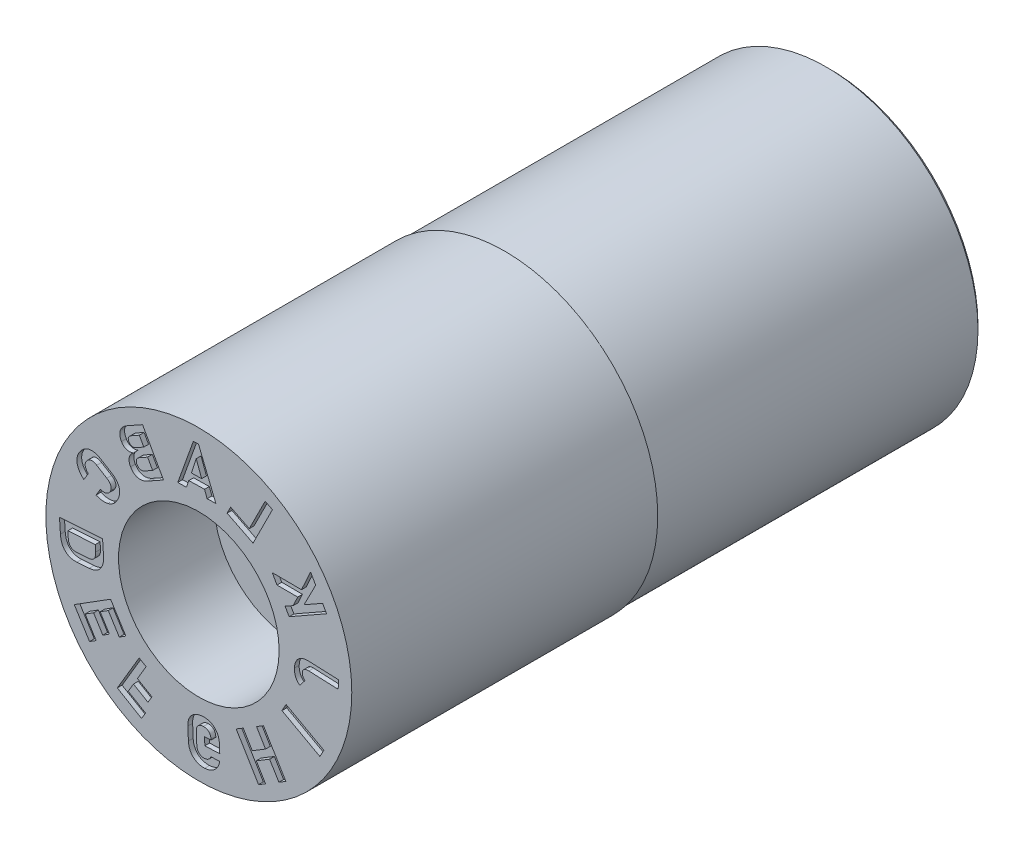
from build123d import *

# Parameters (mm, degrees)
SKETCH4_W          = 17
SKETCH4_H          = 1
CUT_EXTRUDE1_DEPTH = 0.25
CUT_EXTRUDE2_DEPTH = 4


with BuildPart() as part:
    # Sketch1 → Revolve1 (revolve)
    with BuildSketch(Plane(origin=(0, 0, 0), x_dir=(0, 0, -1), z_dir=(1, 0, 0)), mode=Mode.PRIVATE) as revolve1_sk:
        Polygon((0, 8), (0, 4.2), (5, 4.2), (5, 1.75), (25, 1.75), (25, 4), (33, 4), (33, 7.75), (32.75, 8), align=None)
    revolve(revolve1_sk.sketch.rotate(Axis((0, 0, 3.797909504), (0, 0, -1)), 90), axis=Axis((0, 0, 3.797909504), (0, 0, -1)))

    # Sketch4 → Cut-Revolve1 (revolve, cut)
    with BuildSketch(Plane(origin=(0, 0, 0), x_dir=(0, 0, -1), z_dir=(1, 0, 0)), mode=Mode.PRIVATE) as cut_revolve1_sk:
        with Locations((24.5, 8.435)):
            Rectangle(SKETCH4_W, SKETCH4_H)
    revolve(cut_revolve1_sk.sketch.rotate(Axis((0, 0, 0), (0, 0, -1)), 90), axis=Axis((0, 0, 0), (0, 0, -1)), mode=Mode.SUBTRACT)

    # Sketch2 → Cut-Extrude1 (cut)
    # profile 1 of 12: a face of its own
    with BuildSketch(Plane.XY):
        Polygon((5.502223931, 2.733773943), (6.110896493, 3.923586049), (5.846779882, 4.388670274), (5.367336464, 3.347314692), (3.840419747, 3.3592295), (4.088852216, 2.920678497), (5.168723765, 2.915926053), (4.937312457, 2.41329853), (4.513204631, 2.172701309), (4.722858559, 1.803436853), (6.682795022, 2.915312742), (6.473141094, 3.284577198), align=None)
    # profile 2 of 12: a face of its own
    with BuildSketch(Plane.XY):
        Polygon((3.850421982, 6.214323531), (3.468986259, 6.40569852), (2.638563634, 4.749920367), (1.664764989, 5.238328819), (1.480671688, 4.870931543), (2.835745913, 4.191162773), align=None)
    # profile 3 of 12: a face of its own
    with BuildSketch(Plane.XY):
        Polygon((-0.016655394, 7.249090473), (-0.286200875, 7.243373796), (-1.101269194, 4.972182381), (-0.643908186, 4.981728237), (-0.524940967, 5.345476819), (0.300560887, 5.362787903), (0.434750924, 5.004154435), (0.891653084, 5.013681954), align=None)
        Polygon((-0.136899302, 6.531934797), (0.148596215, 5.768925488), (-0.390143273, 5.757627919), align=None, mode=Mode.SUBTRACT)
    # profile 4 of 12: a face of its own
    with BuildSketch(Plane.XY):
        with BuildLine():
            Line((-5.005771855, 0.030105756), (-5.033708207, 0.454883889))
            Line((-5.033708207, 0.454883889), (-7.287144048, 0.30625974))
            Line((-7.287144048, 0.30625974), (-7.238065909, -0.439079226))
            add(Edge.make_bspline(
                [(-7.238065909, -0.439079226), (-7.235177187, -0.484476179), (-7.228057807, -0.551272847), (-7.212324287, -0.637772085), (-7.197605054, -0.698558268), (-7.180815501, -0.756696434), (-7.160896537, -0.812058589), (-7.138320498, -0.864682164), (-7.112461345, -0.914169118), (-7.08486404, -0.961092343), (-7.053614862, -1.004321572), (-7.020792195, -1.045112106), (-6.984345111, -1.081983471), (-6.946242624, -1.116425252), (-6.905231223, -1.147173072), (-6.86202045, -1.175055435), (-6.816043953, -1.199412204), (-6.767884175, -1.220786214), (-6.717531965, -1.238840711), (-6.665015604, -1.252934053), (-6.610532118, -1.264457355), (-6.553758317, -1.272108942), (-6.47398803, -1.277748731), (-6.413023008, -1.27638483), (-6.371930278, -1.274045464)],
                knots=[0, 0, 0, 0, 0.099740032, 0.147123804, 0.192678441, 0.236825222, 0.279748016, 0.321610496, 0.362273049, 0.402114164, 0.440851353, 0.479133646, 0.516792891, 0.554399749, 0.591662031, 0.629051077, 0.667054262, 0.705622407, 0.744501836, 0.784211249, 0.824761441, 0.866533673, 0.909715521, 1, 1, 1, 1], degree=3))
            Line((-6.371930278, -1.274045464), (-5.733167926, -1.231727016))
            add(Edge.make_bspline(
                [(-5.733167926, -1.231727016), (-5.69392494, -1.228982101), (-5.635927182, -1.222367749), (-5.560986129, -1.20645327), (-5.507381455, -1.192953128), (-5.456478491, -1.174493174), (-5.407208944, -1.154358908), (-5.360177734, -1.130883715), (-5.31540439, -1.104483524), (-5.272784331, -1.075324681), (-5.233086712, -1.042582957), (-5.196234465, -1.006933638), (-5.161247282, -0.969088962), (-5.130719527, -0.926969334), (-5.101430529, -0.883057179), (-5.075802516, -0.835517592), (-5.052293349, -0.785385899), (-5.032212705, -0.732126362), (-5.014938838, -0.676543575), (-5.001278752, -0.618391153), (-4.991436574, -0.557572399), (-4.984632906, -0.494029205), (-4.979583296, -0.404210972), (-4.981505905, -0.335482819), (-4.984811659, -0.289089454)],
                knots=[0, 0, 0, 0, 0.086430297, 0.127888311, 0.168207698, 0.207698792, 0.246675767, 0.285052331, 0.323012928, 0.360748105, 0.398340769, 0.435858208, 0.473304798, 0.511339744, 0.549952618, 0.589150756, 0.629809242, 0.671473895, 0.714040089, 0.757555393, 0.802536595, 0.849254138, 0.897843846, 1, 1, 1, 1], degree=3))
            Line((-4.984811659, -0.289089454), (-5.005771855, 0.030105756))
        make_face()
        with BuildLine():
            Line((-5.414831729, 0.003126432), (-5.392975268, -0.327150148))
            add(Edge.make_bspline(
                [(-5.392975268, -0.327150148), (-5.391227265, -0.360110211), (-5.39003815, -0.408495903), (-5.39726629, -0.47087523), (-5.405338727, -0.513675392), (-5.416599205, -0.553933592), (-5.431599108, -0.59139067), (-5.450305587, -0.625922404), (-5.47210218, -0.657781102), (-5.497016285, -0.686391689), (-5.524293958, -0.712343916), (-5.555131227, -0.733910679), (-5.588551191, -0.75234994), (-5.624922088, -0.767421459), (-5.678490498, -0.783189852), (-5.720961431, -0.789611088), (-5.750066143, -0.791100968)],
                knots=[0, 0, 0, 0, 0.149070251, 0.217385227, 0.282879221, 0.345337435, 0.405621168, 0.464448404, 0.522126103, 0.579343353, 0.635280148, 0.691484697, 0.748535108, 0.807147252, 0.868663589, 1, 1, 1, 1], degree=3))
            Line((-5.750066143, -0.791100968), (-6.413651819, -0.834867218))
            add(Edge.make_bspline(
                [(-6.413651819, -0.834867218), (-6.442656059, -0.836848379), (-6.485716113, -0.836918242), (-6.540716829, -0.827336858), (-6.579073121, -0.81814447), (-6.61430842, -0.803277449), (-6.647711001, -0.786019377), (-6.678550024, -0.76435466), (-6.706784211, -0.73891834), (-6.732620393, -0.710344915), (-6.754796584, -0.678047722), (-6.775017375, -0.643246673), (-6.79144843, -0.604787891), (-6.805415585, -0.563601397), (-6.819403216, -0.502446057), (-6.826384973, -0.4547192), (-6.828088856, -0.421623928)],
                knots=[0, 0, 0, 0, 0.131403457, 0.192788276, 0.251650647, 0.308869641, 0.364824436, 0.421034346, 0.478336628, 0.535991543, 0.594369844, 0.654771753, 0.717284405, 0.782701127, 0.850730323, 1, 1, 1, 1], degree=3))
            Line((-6.828088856, -0.421623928), (-6.849933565, -0.091524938))
            Line((-6.849933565, -0.091524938), (-5.414831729, 0.003126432))
        make_face(mode=Mode.SUBTRACT)
    # profile 5 of 12: a face of its own
    with BuildSketch(Plane.XY):
        Polygon((-5.160399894, -2.915524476), (-4.734513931, -2.647796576), (-4.15970231, -3.562637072), (-3.814597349, -3.345802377), (-4.614298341, -2.07275482), (-6.513891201, -3.266910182), (-5.714190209, -4.539957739), (-5.369499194, -4.32292423), (-5.944204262, -3.408253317), (-5.505247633, -3.132308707), (-5.020637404, -3.903101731), (-4.67594639, -3.686068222), align=None)
    # profile 6 of 12: a face of its own
    with BuildSketch(Plane.XY):
        with BuildLine():
            Line((-2.943607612, 6.667834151), (-3.742005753, 6.220422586))
            add(Edge.make_bspline(
                [(-3.742005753, 6.220422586), (-3.80098535, 6.187548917), (-3.883285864, 6.132923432), (-3.975778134, 6.045403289), (-4.031618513, 5.978334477), (-4.076196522, 5.907873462), (-4.108688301, 5.834328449), (-4.128148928, 5.757870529), (-4.136120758, 5.679421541), (-4.131212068, 5.599013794), (-4.108641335, 5.487153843), (-4.072768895, 5.406685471), (-4.043771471, 5.354753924)],
                knots=[0, 0, 0, 0, 0.19478614, 0.282854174, 0.366198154, 0.445691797, 0.522430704, 0.596919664, 0.672178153, 0.748788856, 0.82822861, 1, 1, 1, 1], degree=3))
            add(Edge.make_bspline(
                [(-4.043771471, 5.354753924), (-4.023111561, 5.318814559), (-3.988917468, 5.267574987), (-3.931635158, 5.211327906), (-3.886185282, 5.176392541), (-3.837251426, 5.148155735), (-3.785221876, 5.126400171), (-3.729947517, 5.112529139), (-3.672259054, 5.104595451), (-3.61223114, 5.10421098), (-3.527597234, 5.112790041), (-3.464630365, 5.130444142), (-3.422943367, 5.145334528)],
                knots=[0, 0, 0, 0, 0.172796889, 0.253867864, 0.332914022, 0.410581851, 0.488200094, 0.566646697, 0.646913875, 0.729830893, 0.815675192, 1, 1, 1, 1], degree=3))
            add(Edge.make_bspline(
                [(-3.422943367, 5.145334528), (-3.460286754, 5.116629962), (-3.512891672, 5.070832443), (-3.568064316, 4.998849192), (-3.601019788, 4.94366226), (-3.626583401, 4.88632555), (-3.64282615, 4.826703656), (-3.652279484, 4.765978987), (-3.65187775, 4.70372884), (-3.644388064, 4.64058811), (-3.62234045, 4.553541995), (-3.593985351, 4.49077072), (-3.571048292, 4.450157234)],
                knots=[0, 0, 0, 0, 0.180057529, 0.263783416, 0.344958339, 0.424782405, 0.502382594, 0.580015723, 0.658446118, 0.739020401, 0.822028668, 1, 1, 1, 1], degree=3))
            Line((-3.571048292, 4.450157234), (-3.568984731, 4.446348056))
            add(Edge.make_bspline(
                [(-3.568984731, 4.446348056), (-3.539760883, 4.393634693), (-3.488938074, 4.320771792), (-3.404887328, 4.24181464), (-3.337967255, 4.195997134), (-3.266577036, 4.160982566), (-3.190521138, 4.138553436), (-3.110503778, 4.127277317), (-3.026757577, 4.128524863), (-2.93999668, 4.14109216), (-2.81706612, 4.175298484), (-2.727270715, 4.216564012), (-2.668419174, 4.24990483)],
                knots=[0, 0, 0, 0, 0.172848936, 0.252223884, 0.329273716, 0.404442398, 0.47914627, 0.55555657, 0.635161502, 0.718343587, 0.806128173, 1, 1, 1, 1], degree=3))
            Line((-2.668419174, 4.24990483), (-2.506119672, 4.340726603))
            Line((-2.506119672, 4.340726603), (-1.846939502, 4.710097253))
            Line((-1.846939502, 4.710097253), (-2.943607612, 6.667834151))
        make_face()
        with BuildLine():
            Line((-3.113424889, 6.105467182), (-2.877986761, 5.685170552))
            Line((-2.877986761, 5.685170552), (-3.295321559, 5.451469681))
            add(Edge.make_bspline(
                [(-3.295321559, 5.451469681), (-3.329797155, 5.433542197), (-3.382205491, 5.409072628), (-3.455252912, 5.403065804), (-3.504941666, 5.408745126), (-3.550981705, 5.426078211), (-3.609417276, 5.463195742), (-3.640563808, 5.507561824), (-3.65890238, 5.538283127)],
                knots=[0, 0, 0, 0, 0.277832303, 0.398607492, 0.514671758, 0.628814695, 0.743812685, 1, 1, 1, 1], degree=3))
            add(Edge.make_bspline(
                [(-3.65890238, 5.538283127), (-3.674734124, 5.566749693), (-3.69237853, 5.612821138), (-3.691319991, 5.676495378), (-3.679624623, 5.721567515), (-3.657205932, 5.764365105), (-3.611127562, 5.820142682), (-3.56489115, 5.853204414), (-3.530463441, 5.871932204)],
                knots=[0, 0, 0, 0, 0.243005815, 0.354161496, 0.466965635, 0.585007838, 0.709189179, 1, 1, 1, 1], degree=3))
            Line((-3.530463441, 5.871932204), (-3.113424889, 6.105467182))
        make_face(mode=Mode.SUBTRACT)
        with BuildLine():
            Line((-2.678921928, 5.329806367), (-2.415002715, 4.858666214))
            Line((-2.415002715, 4.858666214), (-2.832093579, 4.625101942))
            add(Edge.make_bspline(
                [(-2.832093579, 4.625101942), (-2.870203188, 4.604974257), (-2.928025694, 4.578453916), (-3.00813582, 4.569570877), (-3.062255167, 4.574472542), (-3.112377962, 4.591659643), (-3.174798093, 4.630636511), (-3.208884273, 4.676659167), (-3.227676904, 4.709470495)],
                knots=[0, 0, 0, 0, 0.283986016, 0.407341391, 0.52341818, 0.636508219, 0.750740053, 1, 1, 1, 1], degree=3))
            Line((-3.227676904, 4.709470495), (-3.230139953, 4.71350614))
            add(Edge.make_bspline(
                [(-3.230139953, 4.71350614), (-3.243211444, 4.736497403), (-3.258987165, 4.772167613), (-3.269167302, 4.821722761), (-3.270753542, 4.857105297), (-3.267461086, 4.89177902), (-3.258301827, 4.925317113), (-3.244177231, 4.958038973), (-3.224090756, 4.989134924), (-3.199203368, 5.018703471), (-3.158770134, 5.057953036), (-3.121737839, 5.081151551), (-3.096059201, 5.096216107)],
                knots=[0, 0, 0, 0, 0.172485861, 0.251675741, 0.32832506, 0.402454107, 0.477688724, 0.553908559, 0.633798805, 0.717922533, 0.805334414, 1, 1, 1, 1], degree=3))
            Line((-3.096059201, 5.096216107), (-2.678921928, 5.329806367))
        make_face(mode=Mode.SUBTRACT)
    # profile 7 of 12: a face of its own
    with BuildSketch(Plane.XY):
        Polygon((-3.20996666, -4.96605246), (-2.756429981, -4.199288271), (-3.120476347, -3.98389489), (-4.262888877, -5.9152955), (-2.994365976, -6.665943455), (-2.786802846, -6.315475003), (-3.691537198, -5.780211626), (-3.417334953, -5.316636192), (-2.659321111, -5.765130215), (-2.451757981, -5.414661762), align=None)
    # profile 8 of 12: a face of its own
    with BuildSketch(Plane.XY):
        with BuildLine():
            Line((-4.578848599, 3.6842024), (-5.107936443, 4.008085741))
            add(Edge.make_bspline(
                [(-5.107936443, 4.008085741), (-5.144546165, 4.030587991), (-5.200008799, 4.061446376), (-5.275713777, 4.095831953), (-5.330999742, 4.117383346), (-5.385908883, 4.134634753), (-5.439989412, 4.149412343), (-5.49384418, 4.15876552), (-5.546958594, 4.165028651), (-5.599390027, 4.167081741), (-5.651039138, 4.165529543), (-5.701803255, 4.160462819), (-5.75135686, 4.150936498), (-5.800052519, 4.138147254), (-5.84761518, 4.121388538), (-5.894559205, 4.101213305), (-5.940093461, 4.076638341), (-5.984661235, 4.048648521), (-6.028006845, 4.017216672), (-6.069756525, 3.981813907), (-6.109838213, 3.942489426), (-6.148695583, 3.899936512), (-6.19936144, 3.837253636), (-6.23380003, 3.786391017), (-6.255527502, 3.750860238)],
                knots=[0, 0, 0, 0, 0.096418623, 0.142170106, 0.186461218, 0.229442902, 0.271254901, 0.31212696, 0.351940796, 0.391171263, 0.429722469, 0.467793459, 0.505489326, 0.542812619, 0.580645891, 0.618521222, 0.657328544, 0.696599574, 0.736521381, 0.777345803, 0.819284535, 0.86241413, 0.906559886, 1, 1, 1, 1], degree=3))
            add(Edge.make_bspline(
                [(-6.255527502, 3.750860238), (-6.290307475, 3.692909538), (-6.334748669, 3.60234662), (-6.36683241, 3.474132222), (-6.377942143, 3.378779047), (-6.37642015, 3.283072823), (-6.362078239, 3.187770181), (-6.334366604, 3.093474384), (-6.294233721, 3.000357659), (-6.242056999, 2.908766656), (-6.153516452, 2.786715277), (-6.071910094, 2.704259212), (-6.01255099, 2.652304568)],
                knots=[0, 0, 0, 0, 0.164359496, 0.242522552, 0.319818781, 0.396757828, 0.474196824, 0.553044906, 0.634665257, 0.71980849, 0.808406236, 1, 1, 1, 1], degree=3))
            Line((-6.01255099, 2.652304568), (-5.781809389, 3.029538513))
            add(Edge.make_bspline(
                [(-5.781809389, 3.029538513), (-5.807341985, 3.055056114), (-5.844217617, 3.093759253), (-5.882636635, 3.151452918), (-5.905792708, 3.194063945), (-5.92277385, 3.237189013), (-5.935989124, 3.27995293), (-5.941923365, 3.323055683), (-5.943514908, 3.365663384), (-5.939804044, 3.40792915), (-5.925495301, 3.46376181), (-5.907679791, 3.503650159), (-5.892003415, 3.528494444)],
                knots=[0, 0, 0, 0, 0.195176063, 0.286539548, 0.373239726, 0.456219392, 0.536212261, 0.614027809, 0.690102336, 0.765907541, 0.841950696, 1, 1, 1, 1], degree=3))
            add(Edge.make_bspline(
                [(-5.892003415, 3.528494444), (-5.872853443, 3.560459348), (-5.839572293, 3.603948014), (-5.786333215, 3.650801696), (-5.744836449, 3.677997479), (-5.700446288, 3.697477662), (-5.653745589, 3.709767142), (-5.604762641, 3.714869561), (-5.55370527, 3.712974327), (-5.501326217, 3.702819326), (-5.426894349, 3.680914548), (-5.373830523, 3.652216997), (-5.33848399, 3.631471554)],
                knots=[0, 0, 0, 0, 0.174815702, 0.254583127, 0.331751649, 0.406600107, 0.480982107, 0.557388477, 0.636835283, 0.719715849, 0.807055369, 1, 1, 1, 1], degree=3))
            Line((-5.33848399, 3.631471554), (-4.809396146, 3.307588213))
            add(Edge.make_bspline(
                [(-4.809396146, 3.307588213), (-4.77438739, 3.286287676), (-4.725930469, 3.250852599), (-4.67165426, 3.195678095), (-4.63935148, 3.153369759), (-4.614452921, 3.109128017), (-4.597207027, 3.06313011), (-4.587169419, 3.015956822), (-4.58438334, 2.967509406), (-4.589376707, 2.918106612), (-4.606911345, 2.849244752), (-4.63125844, 2.800080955), (-4.650603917, 2.768236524)],
                knots=[0, 0, 0, 0, 0.192501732, 0.280291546, 0.362663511, 0.441768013, 0.517825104, 0.592476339, 0.667438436, 0.744799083, 0.824735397, 1, 1, 1, 1], degree=3))
            add(Edge.make_bspline(
                [(-4.650603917, 2.768236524), (-4.666334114, 2.743017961), (-4.692989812, 2.707517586), (-4.737205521, 2.669579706), (-4.772877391, 2.646157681), (-4.811609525, 2.627780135), (-4.852564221, 2.613091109), (-4.896472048, 2.605463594), (-4.942473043, 2.601621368), (-4.990661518, 2.602772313), (-5.059450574, 2.612315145), (-5.110732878, 2.627405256), (-5.145114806, 2.639637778)],
                knots=[0, 0, 0, 0, 0.160080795, 0.236116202, 0.312169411, 0.388723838, 0.466100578, 0.545220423, 0.627432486, 0.713976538, 0.803688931, 1, 1, 1, 1], degree=3))
            Line((-5.145114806, 2.639637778), (-5.375856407, 2.262403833))
            add(Edge.make_bspline(
                [(-5.375856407, 2.262403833), (-5.302120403, 2.233991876), (-5.191441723, 2.198878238), (-5.0423306, 2.175726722), (-4.93707929, 2.171089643), (-4.835896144, 2.177209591), (-4.739618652, 2.195586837), (-4.648474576, 2.225928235), (-4.56284113, 2.267711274), (-4.482587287, 2.320385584), (-4.383769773, 2.408014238), (-4.322046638, 2.487627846), (-4.286866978, 2.545463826)],
                knots=[0, 0, 0, 0, 0.192101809, 0.280672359, 0.365807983, 0.447541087, 0.526353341, 0.603189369, 0.680187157, 0.757177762, 0.835634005, 1, 1, 1, 1], degree=3))
            add(Edge.make_bspline(
                [(-4.286866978, 2.545463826), (-4.265319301, 2.581038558), (-4.235137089, 2.634720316), (-4.203064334, 2.708620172), (-4.182508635, 2.762487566), (-4.166238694, 2.816024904), (-4.153084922, 2.86911926), (-4.144507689, 2.921904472), (-4.139583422, 2.974295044), (-4.138857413, 3.025931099), (-4.141114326, 3.076796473), (-4.148192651, 3.126792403), (-4.158947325, 3.175931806), (-4.173240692, 3.224387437), (-4.191461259, 3.271860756), (-4.213183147, 3.318702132), (-4.239368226, 3.364230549), (-4.268786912, 3.408976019), (-4.302468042, 3.452075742), (-4.339581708, 3.494069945), (-4.380034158, 3.534894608), (-4.424221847, 3.574444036), (-4.489496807, 3.625979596), (-4.541757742, 3.662199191), (-4.578848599, 3.6842024)],
                knots=[0, 0, 0, 0, 0.093394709, 0.137866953, 0.180684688, 0.222705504, 0.263356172, 0.303339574, 0.342594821, 0.381331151, 0.419141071, 0.456735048, 0.494484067, 0.531939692, 0.569987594, 0.608497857, 0.6476809, 0.687739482, 0.728571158, 0.770310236, 0.813445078, 0.857467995, 0.903296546, 1, 1, 1, 1], degree=3))
        make_face()
    # profile 9 of 12: a face of its own
    with BuildSketch(Plane.XY):
        Polygon((3.702942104, -5.160868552), (4.186096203, -5.962529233), (4.551475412, -5.742393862), (3.382798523, -3.803297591), (3.017419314, -4.023432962), (3.490770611, -4.808828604), (2.79425656, -5.228680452), (2.320728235, -4.442991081), (1.955349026, -4.663126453), (3.124025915, -6.602222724), (3.489405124, -6.382087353), (3.006428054, -5.5807204), align=None)
    # profile 10 of 12: a face of its own
    with BuildSketch(Plane.XY):
        with BuildLine():
            Line((1.096526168, -6.216696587), (1.078050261, -5.776275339))
            add(Edge.make_bspline(
                [(1.078050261, -5.776275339), (1.075735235, -5.735645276), (1.071187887, -5.675422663), (1.056827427, -5.597366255), (1.043288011, -5.541585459), (1.026733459, -5.487727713), (1.007056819, -5.435834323), (0.984329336, -5.386038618), (0.958512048, -5.338372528), (0.929913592, -5.293029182), (0.89832558, -5.250566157), (0.865109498, -5.210180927), (0.828555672, -5.173297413), (0.789654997, -5.139111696), (0.748018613, -5.108263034), (0.704500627, -5.079301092), (0.658021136, -5.054082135), (0.609654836, -5.031487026), (0.55937053, -5.01210832), (0.507208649, -4.996560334), (0.453605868, -4.983364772), (0.398081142, -4.974388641), (0.320904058, -4.966976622), (0.261969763, -4.965399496), (0.222278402, -4.967616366)],
                knots=[0, 0, 0, 0, 0.092114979, 0.136277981, 0.1793654, 0.221873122, 0.26362554, 0.304798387, 0.345574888, 0.386143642, 0.42592481, 0.465205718, 0.504301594, 0.543231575, 0.582216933, 0.621416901, 0.66136043, 0.701681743, 0.742093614, 0.783108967, 0.824710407, 0.866861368, 0.910181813, 1, 1, 1, 1], degree=3))
            add(Edge.make_bspline(
                [(0.222278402, -4.967616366), (0.182422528, -4.969911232), (0.123231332, -4.974236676), (0.046624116, -4.988699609), (-0.008196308, -5.001461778), (-0.060977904, -5.017640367), (-0.111878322, -5.036664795), (-0.160898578, -5.058978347), (-0.207845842, -5.084114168), (-0.252596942, -5.111935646), (-0.294592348, -5.142265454), (-0.334013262, -5.174689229), (-0.370456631, -5.209858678), (-0.403915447, -5.247678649), (-0.43459265, -5.287902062), (-0.463219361, -5.330015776), (-0.487929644, -5.375019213), (-0.510570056, -5.421662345), (-0.529123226, -5.470475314), (-0.545461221, -5.520600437), (-0.557227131, -5.57266228), (-0.566855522, -5.625972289), (-0.573707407, -5.700619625), (-0.574928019, -5.757509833), (-0.573064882, -5.795972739)],
                knots=[0, 0, 0, 0, 0.092698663, 0.137285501, 0.180720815, 0.223200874, 0.265242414, 0.306681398, 0.34803511, 0.388686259, 0.428814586, 0.468112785, 0.50698522, 0.546164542, 0.585119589, 0.624268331, 0.664152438, 0.704099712, 0.744433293, 0.78518356, 0.826278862, 0.86813407, 0.910753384, 1, 1, 1, 1], degree=3))
            Line((-0.573064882, -5.795972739), (-0.545435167, -6.460990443))
            add(Edge.make_bspline(
                [(-0.545435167, -6.460990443), (-0.54312008, -6.501620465), (-0.538572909, -6.561843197), (-0.524212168, -6.639899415), (-0.510673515, -6.695680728), (-0.494116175, -6.749536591), (-0.47444969, -6.801436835), (-0.451685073, -6.851207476), (-0.426068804, -6.898846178), (-0.39709785, -6.943677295), (-0.366322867, -6.986579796), (-0.332599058, -7.026423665), (-0.295935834, -7.063144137), (-0.256979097, -7.097032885), (-0.21599183, -7.128934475), (-0.171932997, -7.157308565), (-0.125470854, -7.182759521), (-0.077076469, -7.205330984), (-0.026779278, -7.224626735), (0.025070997, -7.24046706), (0.078932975, -7.252284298), (0.134088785, -7.262046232), (0.211314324, -7.26956655), (0.270100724, -7.270097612), (0.309761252, -7.268316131)],
                knots=[0, 0, 0, 0, 0.092189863, 0.136388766, 0.179511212, 0.22205349, 0.263839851, 0.305046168, 0.345855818, 0.386150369, 0.425784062, 0.465296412, 0.504157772, 0.5431194, 0.582111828, 0.621616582, 0.661592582, 0.701946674, 0.742391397, 0.783440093, 0.824531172, 0.867138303, 0.910153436, 1, 1, 1, 1], degree=3))
            add(Edge.make_bspline(
                [(0.309761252, -7.268316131), (0.374911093, -7.265843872), (0.471107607, -7.251195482), (0.59344708, -7.211846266), (0.678942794, -7.171495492), (0.758649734, -7.122251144), (0.831833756, -7.064682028), (0.896951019, -6.998018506), (0.95474707, -6.923906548), (1.004027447, -6.842698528), (1.057555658, -6.724876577), (1.082175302, -6.629893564), (1.09234321, -6.565039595)],
                knots=[0, 0, 0, 0, 0.170730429, 0.253555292, 0.336068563, 0.417894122, 0.498687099, 0.579504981, 0.661559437, 0.744542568, 0.827905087, 1, 1, 1, 1], degree=3))
            Line((1.09234321, -6.565039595), (0.633542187, -6.584172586))
            add(Edge.make_bspline(
                [(0.633542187, -6.584172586), (0.626530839, -6.607534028), (0.613497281, -6.64219168), (0.586091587, -6.682737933), (0.562924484, -6.711212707), (0.535900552, -6.736431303), (0.506231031, -6.758880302), (0.474318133, -6.778651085), (0.440193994, -6.795614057), (0.404241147, -6.808406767), (0.3550516, -6.822361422), (0.316815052, -6.826550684), (0.291285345, -6.827894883)],
                knots=[0, 0, 0, 0, 0.163544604, 0.24436254, 0.326081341, 0.408335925, 0.490615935, 0.574313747, 0.65882608, 0.744664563, 0.828910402, 1, 1, 1, 1], degree=3))
            add(Edge.make_bspline(
                [(0.291285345, -6.827894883), (0.255619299, -6.829373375), (0.20269424, -6.826082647), (0.135887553, -6.807859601), (0.090021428, -6.788213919), (0.048108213, -6.762212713), (0.010530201, -6.730723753), (-0.021971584, -6.69355337), (-0.050161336, -6.651618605), (-0.072778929, -6.604795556), (-0.096685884, -6.535770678), (-0.103591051, -6.480200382), (-0.105471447, -6.44255384)],
                knots=[0, 0, 0, 0, 0.172157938, 0.253142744, 0.332680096, 0.41175775, 0.489998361, 0.568043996, 0.648934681, 0.732771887, 0.817932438, 1, 1, 1, 1], degree=3))
            Line((-0.105471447, -6.44255384), (-0.133101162, -5.777536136))
            add(Edge.make_bspline(
                [(-0.133101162, -5.777536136), (-0.135079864, -5.744089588), (-0.130903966, -5.69462429), (-0.113083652, -5.632080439), (-0.093567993, -5.589394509), (-0.068744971, -5.550014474), (-0.038319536, -5.51497022), (-0.002659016, -5.484307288), (0.038315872, -5.458816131), (0.083457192, -5.438021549), (0.150444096, -5.416172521), (0.204242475, -5.410251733), (0.240754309, -5.408037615)],
                knots=[0, 0, 0, 0, 0.169495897, 0.249302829, 0.328489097, 0.406527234, 0.484422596, 0.562783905, 0.643966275, 0.728132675, 0.814123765, 1, 1, 1, 1], degree=3))
            add(Edge.make_bspline(
                [(0.240754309, -5.408037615), (0.276829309, -5.406751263), (0.330271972, -5.409413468), (0.397886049, -5.42695691), (0.443775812, -5.446158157), (0.485915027, -5.470548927), (0.523205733, -5.501267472), (0.555803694, -5.537266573), (0.583625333, -5.578588), (0.605245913, -5.625026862), (0.628744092, -5.694361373), (0.634843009, -5.750628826), (0.637118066, -5.788803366)],
                knots=[0, 0, 0, 0, 0.174469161, 0.25602761, 0.336001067, 0.413903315, 0.490187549, 0.568212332, 0.647582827, 0.729648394, 0.814770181, 1, 1, 1, 1], degree=3))
            Line((0.637118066, -5.788803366), (0.638929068, -5.825981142))
            Line((0.638929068, -5.825981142), (0.298184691, -5.840503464))
            Line((0.298184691, -5.840503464), (0.315360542, -6.249694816))
            Line((0.315360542, -6.249694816), (1.096526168, -6.216696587))
        make_face()
    # profile 11 of 12: a face of its own
    with BuildSketch(Plane.XY):
        Polygon((4.559710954, -2.249823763), (4.347395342, -2.636602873), (6.328949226, -3.7233215), (6.541264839, -3.336542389), align=None)
    # profile 12 of 12: a face of its own
    with BuildSketch(Plane.XY):
        with BuildLine():
            Line((5.281321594, -1.018562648), (5.548429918, -0.682261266))
            add(Edge.make_bspline(
                [(5.548429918, -0.682261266), (5.525853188, -0.66348883), (5.495673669, -0.63132371), (5.463298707, -0.582737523), (5.443646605, -0.543976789), (5.428217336, -0.50376673), (5.414582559, -0.448660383), (5.411007, -0.406337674), (5.412629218, -0.378204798)],
                knots=[0, 0, 0, 0, 0.255231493, 0.381315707, 0.506998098, 0.632722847, 0.755324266, 1, 1, 1, 1], degree=3))
            add(Edge.make_bspline(
                [(5.412629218, -0.378204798), (5.41418746, -0.341471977), (5.425160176, -0.286284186), (5.466339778, -0.226490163), (5.506307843, -0.190399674), (5.556133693, -0.163292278), (5.638406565, -0.138535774), (5.705877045, -0.134203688), (5.752613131, -0.136745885)],
                knots=[0, 0, 0, 0, 0.235578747, 0.34493456, 0.456480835, 0.57496348, 0.702365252, 1, 1, 1, 1], degree=3))
            Line((5.752613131, -0.136745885), (7.288297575, -0.202593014))
            Line((7.288297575, -0.202593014), (7.307213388, 0.237350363))
            Line((7.307213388, 0.237350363), (5.769699, 0.303356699))
            add(Edge.make_bspline(
                [(5.769699, 0.303356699), (5.696983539, 0.307075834), (5.590590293, 0.301651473), (5.455859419, 0.272026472), (5.380612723, 0.243874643), (5.324874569, 0.216398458), (5.286212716, 0.192787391), (5.249020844, 0.167812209), (5.215385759, 0.13893486), (5.183447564, 0.108478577), (5.153616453, 0.075516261), (5.126765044, 0.039579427), (5.102026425, 0.001450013), (5.08018565, -0.039095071), (5.0606576, -0.081874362), (5.044022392, -0.126836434), (5.029661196, -0.173901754), (5.018061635, -0.223243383), (5.00582421, -0.293193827), (5.000820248, -0.34715809), (4.999139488, -0.383716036)],
                knots=[0, 0, 0, 0, 0.185996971, 0.270621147, 0.351640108, 0.390621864, 0.429278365, 0.467346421, 0.504967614, 0.542395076, 0.580107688, 0.618424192, 0.65692399, 0.69616986, 0.736011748, 0.777014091, 0.81860016, 0.861698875, 0.906467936, 1, 1, 1, 1], degree=3))
            add(Edge.make_bspline(
                [(4.999139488, -0.383716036), (4.996403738, -0.449514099), (5.001585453, -0.546931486), (5.030007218, -0.671332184), (5.06192613, -0.756679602), (5.102867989, -0.835380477), (5.170145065, -0.928984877), (5.233936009, -0.987142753), (5.281321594, -1.018562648)],
                knots=[0, 0, 0, 0, 0.271973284, 0.400311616, 0.52557417, 0.647267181, 0.76561072, 1, 1, 1, 1], degree=3))
        make_face()
    extrude(amount=-CUT_EXTRUDE1_DEPTH, mode=Mode.SUBTRACT)

    # Sketch3 → Cut-Extrude2 (cut)
    with BuildSketch(Plane.XY.offset(-5)):
        Polygon((1.010362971, 1.75), (-1.010362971, 1.75), (-2.020725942, 0), (-1.010362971, -1.75), (1.010362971, -1.75), (2.020725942, 0), align=None)
    extrude(amount=-CUT_EXTRUDE2_DEPTH, mode=Mode.SUBTRACT)


solid = part.part
